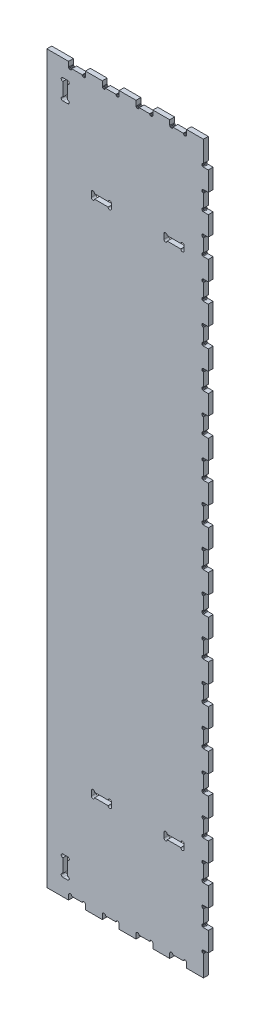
from build123d import *

# Parameters (mm, degrees)
BOSS_EXTRUDE1_DEPTH = 12


with BuildPart() as part:
    # Sketch1 → Boss-Extrude1 (new body)
    with BuildSketch(Plane.XY):
        Polygon((-145.403955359, -2312), (-145.287955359, -2312), (-145.287955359, -2311.04), (-144.397955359, -2309.35), (-142.822955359, -2308.26), (-140.921955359, -2308.03), (-139.131955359, -2308.71), (-137.861955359, -2310.14), (-137.403955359, -2312), (-111.509955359, -2312), (-111.509955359, -2311.04), (-110.619955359, -2309.35), (-109.044955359, -2308.26), (-107.143955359, -2308.03), (-105.353955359, -2308.71), (-104.084955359, -2310.14), (-103.625955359, -2312), (-103.625955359, -2324), (-61.848655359, -2324), (-61.848655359, -2312), (-61.732355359, -2312), (-61.732355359, -2311.04), (-60.842655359, -2309.35), (-59.267055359, -2308.26), (-57.366455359, -2308.03), (-55.576355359, -2308.71), (-54.306755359, -2310.14), (-53.848655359, -2312), (-27.954555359, -2312), (-27.954555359, -2311.04), (-27.064855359, -2309.35), (-25.489255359, -2308.26), (-23.588655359, -2308.03), (-21.798555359, -2308.71), (-20.529055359, -2310.14), (-20.070855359, -2312), (-20.070855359, -2324), (21.706944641, -2324), (21.706944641, -2312), (21.823144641, -2312), (21.823144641, -2311.04), (22.712844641, -2309.35), (24.288544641, -2308.26), (26.189044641, -2308.03), (27.979144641, -2308.71), (29.248744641, -2310.14), (29.706944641, -2312), (55.600944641, -2312), (55.600944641, -2311.04), (56.490644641, -2309.35), (58.066244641, -2308.26), (59.966844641, -2308.03), (61.756944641, -2308.71), (63.026544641, -2310.14), (63.484744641, -2312), (63.484744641, -2324), (105.262044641, -2324), (105.262044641, -2312), (105.379044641, -2312), (105.379044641, -2311.04), (106.268044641, -2309.35), (107.844044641, -2308.26), (109.745044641, -2308.03), (111.535044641, -2308.71), (112.804044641, -2310.14), (113.262044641, -2312), (139.156044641, -2312), (139.156044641, -2311.04), (140.046044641, -2309.35), (141.622044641, -2308.26), (143.522044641, -2308.03), (145.312044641, -2308.71), (146.582044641, -2310.14), (147.040044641, -2312), (147.040044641, -2324), (188.818044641, -2324), (188.818044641, -2271.91), (187.400044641, -2271.74), (185.824044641, -2270.65), (184.934044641, -2268.96), (184.934044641, -2267.04), (185.824044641, -2265.35), (187.400044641, -2264.26), (189.300044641, -2264.03), (189.751044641, -2264.2), (200.818044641, -2264.2), (200.818044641, -2216), (188.818044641, -2216), (188.818044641, -2215.91), (187.400044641, -2215.74), (185.824044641, -2214.65), (184.934044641, -2212.96), (184.934044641, -2211.04), (185.824044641, -2209.35), (187.400044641, -2208.26), (188.818044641, -2208.09), (188.818044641, -2175.91), (187.400044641, -2175.74), (185.824044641, -2174.65), (184.934044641, -2172.96), (184.934044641, -2171.04), (185.824044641, -2169.35), (187.400044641, -2168.26), (189.300044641, -2168.03), (189.751044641, -2168.2), (200.818044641, -2168.2), (200.818044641, -2120), (188.818044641, -2120), (188.818044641, -2119.91), (187.400044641, -2119.74), (185.824044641, -2118.65), (184.934044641, -2116.96), (184.934044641, -2115.04), (185.824044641, -2113.35), (187.400044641, -2112.26), (188.818044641, -2112.09), (188.818044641, -2079.91), (187.400044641, -2079.74), (185.824044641, -2078.65), (184.934044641, -2076.96), (184.934044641, -2075.04), (185.824044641, -2073.35), (187.400044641, -2072.26), (189.300044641, -2072.03), (189.751044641, -2072.2), (200.818044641, -2072.2), (200.818044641, -2024), (188.818044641, -2024), (188.818044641, -2023.91), (187.400044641, -2023.74), (185.824044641, -2022.65), (184.934044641, -2020.96), (184.934044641, -2019.04), (185.824044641, -2017.35), (187.400044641, -2016.26), (188.818044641, -2016.09), (188.818044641, -1983.91), (187.400044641, -1983.74), (185.824044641, -1982.65), (184.934044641, -1980.96), (184.934044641, -1979.04), (185.824044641, -1977.35), (187.400044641, -1976.26), (189.300044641, -1976.03), (189.751044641, -1976.2), (200.818044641, -1976.2), (200.818044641, -1928), (188.818044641, -1928), (188.818044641, -1927.91), (187.400044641, -1927.74), (185.824044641, -1926.65), (184.934044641, -1924.96), (184.934044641, -1923.04), (185.824044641, -1921.35), (187.400044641, -1920.26), (188.818044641, -1920.09), (188.818044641, -1887.91), (187.400044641, -1887.74), (185.824044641, -1886.65), (184.934044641, -1884.96), (184.934044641, -1883.04), (185.824044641, -1881.35), (187.400044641, -1880.26), (189.300044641, -1880.03), (189.751044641, -1880.2), (200.818044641, -1880.2), (200.818044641, -1832), (188.818044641, -1832), (188.818044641, -1831.91), (187.400044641, -1831.74), (185.824044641, -1830.65), (184.934044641, -1828.96), (184.934044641, -1827.04), (185.824044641, -1825.35), (187.400044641, -1824.26), (188.818044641, -1824.09), (188.818044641, -1791.91), (187.400044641, -1791.74), (185.824044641, -1790.65), (184.934044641, -1788.96), (184.934044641, -1787.04), (185.824044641, -1785.35), (187.400044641, -1784.26), (189.300044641, -1784.03), (189.751044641, -1784.2), (200.818044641, -1784.2), (200.818044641, -1736), (188.818044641, -1736), (188.818044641, -1735.91), (187.400044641, -1735.74), (185.824044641, -1734.65), (184.934044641, -1732.96), (184.934044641, -1731.04), (185.824044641, -1729.35), (187.400044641, -1728.26), (188.818044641, -1728.09), (188.818044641, -1695.91), (187.400044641, -1695.74), (185.824044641, -1694.65), (184.934044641, -1692.96), (184.934044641, -1691.04), (185.824044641, -1689.35), (187.400044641, -1688.26), (189.300044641, -1688.03), (189.751044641, -1688.2), (200.818044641, -1688.2), (200.818044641, -1640), (188.818044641, -1640), (188.818044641, -1639.91), (187.400044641, -1639.74), (185.824044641, -1638.65), (184.934044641, -1636.96), (184.934044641, -1635.04), (185.824044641, -1633.35), (187.400044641, -1632.26), (188.818044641, -1632.09), (188.818044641, -1599.91), (187.400044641, -1599.74), (185.824044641, -1598.65), (184.934044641, -1596.96), (184.934044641, -1595.04), (185.824044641, -1593.35), (187.400044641, -1592.26), (189.300044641, -1592.03), (189.751044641, -1592.2), (200.818044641, -1592.2), (200.818044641, -1544), (188.818044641, -1544), (188.818044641, -1543.91), (187.400044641, -1543.74), (185.824044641, -1542.65), (184.934044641, -1540.96), (184.934044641, -1539.04), (185.824044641, -1537.35), (187.400044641, -1536.26), (188.818044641, -1536.09), (188.818044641, -1503.91), (187.400044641, -1503.74), (185.824044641, -1502.65), (184.934044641, -1500.96), (184.934044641, -1499.04), (185.824044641, -1497.35), (187.400044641, -1496.26), (189.300044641, -1496.03), (189.751044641, -1496.2), (200.818044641, -1496.2), (200.818044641, -1448), (188.818044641, -1448), (188.818044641, -1447.91), (187.400044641, -1447.74), (185.824044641, -1446.65), (184.934044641, -1444.96), (184.934044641, -1443.04), (185.824044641, -1441.35), (187.400044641, -1440.26), (188.818044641, -1440.09), (188.818044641, -1407.91), (187.400044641, -1407.74), (185.824044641, -1406.65), (184.934044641, -1404.96), (184.934044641, -1403.04), (185.824044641, -1401.35), (187.400044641, -1400.26), (189.300044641, -1400.03), (189.751044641, -1400.2), (200.818044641, -1400.2), (200.818044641, -1352), (188.818044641, -1352), (188.818044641, -1351.91), (187.400044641, -1351.74), (185.824044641, -1350.65), (184.934044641, -1348.96), (184.934044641, -1347.04), (185.824044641, -1345.35), (187.400044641, -1344.26), (188.818044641, -1344.09), (188.818044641, -1311.91), (187.400044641, -1311.74), (185.824044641, -1310.65), (184.934044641, -1308.96), (184.934044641, -1307.04), (185.824044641, -1305.35), (187.400044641, -1304.26), (189.300044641, -1304.03), (189.751044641, -1304.2), (200.818044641, -1304.2), (200.818044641, -1256), (188.818044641, -1256), (188.818044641, -1255.91), (187.400044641, -1255.74), (185.824044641, -1254.65), (184.934044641, -1252.96), (184.934044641, -1251.04), (185.824044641, -1249.35), (187.400044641, -1248.26), (188.818044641, -1248.09), (188.818044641, -1215.91), (187.400044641, -1215.74), (185.824044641, -1214.65), (184.934044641, -1212.96), (184.934044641, -1211.04), (185.824044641, -1209.35), (187.400044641, -1208.26), (189.300044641, -1208.03), (189.751044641, -1208.2), (200.818044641, -1208.2), (200.818044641, -1160), (188.818044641, -1160), (188.818044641, -1159.91), (187.400044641, -1159.74), (185.824044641, -1158.65), (184.934044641, -1156.96), (184.934044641, -1155.04), (185.824044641, -1153.35), (187.400044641, -1152.26), (188.818044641, -1152.09), (188.818044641, -1119.91), (187.400044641, -1119.74), (185.824044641, -1118.65), (184.934044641, -1116.96), (184.934044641, -1115.04), (185.824044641, -1113.35), (187.400044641, -1112.26), (189.300044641, -1112.03), (189.751044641, -1112.2), (200.818044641, -1112.2), (200.818044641, -1064), (188.818044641, -1064), (188.818044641, -1063.91), (187.400044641, -1063.74), (185.824044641, -1062.65), (184.934044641, -1060.96), (184.934044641, -1059.04), (185.824044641, -1057.35), (187.400044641, -1056.26), (188.818044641, -1056.09), (188.818044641, -1023.91), (187.400044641, -1023.74), (185.824044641, -1022.65), (184.934044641, -1020.96), (184.934044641, -1019.04), (185.824044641, -1017.35), (187.400044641, -1016.26), (189.300044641, -1016.03), (189.751044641, -1016.2), (200.818044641, -1016.2), (200.818044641, -968), (188.818044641, -968), (188.818044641, -967.912), (187.400044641, -967.74), (185.824044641, -966.652), (184.934044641, -964.957), (184.934044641, -963.043), (185.824044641, -961.348), (187.400044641, -960.26), (188.818044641, -960.088), (188.818044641, -927.912), (187.400044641, -927.74), (185.824044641, -926.652), (184.934044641, -924.957), (184.934044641, -923.043), (185.824044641, -921.348), (187.400044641, -920.26), (189.300044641, -920.029), (189.751044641, -920.2), (200.818044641, -920.2), (200.818044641, -872), (188.818044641, -872), (188.818044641, -871.912), (187.400044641, -871.74), (185.824044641, -870.652), (184.934044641, -868.957), (184.934044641, -867.043), (185.824044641, -865.348), (187.400044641, -864.26), (188.818044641, -864.088), (188.818044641, -831.912), (187.400044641, -831.74), (185.824044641, -830.652), (184.934044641, -828.957), (184.934044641, -827.043), (185.824044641, -825.348), (187.400044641, -824.26), (189.300044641, -824.029), (189.751044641, -824.2), (200.818044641, -824.2), (200.818044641, -776), (188.818044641, -776), (188.818044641, -775.912), (187.400044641, -775.74), (185.824044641, -774.652), (184.934044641, -772.957), (184.934044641, -771.043), (185.824044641, -769.348), (187.400044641, -768.26), (188.818044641, -768.088), (188.818044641, -735.912), (187.400044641, -735.74), (185.824044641, -734.652), (184.934044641, -732.957), (184.934044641, -731.043), (185.824044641, -729.348), (187.400044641, -728.26), (189.300044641, -728.029), (189.751044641, -728.2), (200.818044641, -728.2), (200.818044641, -680), (188.818044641, -680), (188.818044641, -679.912), (187.400044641, -679.74), (185.824044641, -678.652), (184.934044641, -676.957), (184.934044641, -675.043), (185.824044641, -673.348), (187.400044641, -672.26), (188.818044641, -672.088), (188.818044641, -639.912), (187.400044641, -639.74), (185.824044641, -638.652), (184.934044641, -636.957), (184.934044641, -635.043), (185.824044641, -633.348), (187.400044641, -632.26), (189.300044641, -632.029), (189.751044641, -632.2), (200.818044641, -632.2), (200.818044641, -584), (188.818044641, -584), (188.818044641, -583.912), (187.400044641, -583.74), (185.824044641, -582.652), (184.934044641, -580.957), (184.934044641, -579.043), (185.824044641, -577.348), (187.400044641, -576.26), (188.818044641, -576.088), (188.818044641, -524), (147.040044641, -524), (147.040044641, -536), (146.582044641, -537.859), (145.312044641, -539.292), (143.522044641, -539.971), (141.622044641, -539.74), (140.046044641, -538.652), (139.156044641, -536.957), (139.156044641, -536), (113.262044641, -536), (112.804044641, -537.859), (111.535044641, -539.292), (109.745044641, -539.971), (107.844044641, -539.74), (106.268044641, -538.652), (105.379044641, -536.957), (105.379044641, -536), (105.262044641, -536), (105.262044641, -524), (63.484744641, -524), (63.484744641, -536), (63.026544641, -537.859), (61.756944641, -539.292), (59.966844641, -539.971), (58.066244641, -539.74), (56.490644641, -538.652), (55.600944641, -536.957), (55.600944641, -536), (29.706944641, -536), (29.248744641, -537.859), (27.979144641, -539.292), (26.189044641, -539.971), (24.288544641, -539.74), (22.712844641, -538.652), (21.823144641, -536.957), (21.823144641, -536), (21.706944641, -536), (21.706944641, -524), (-20.070855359, -524), (-20.070855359, -536), (-20.529055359, -537.859), (-21.798555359, -539.292), (-23.588655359, -539.971), (-25.489255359, -539.74), (-27.064855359, -538.652), (-27.954555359, -536.957), (-27.954555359, -536), (-53.848655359, -536), (-54.306755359, -537.859), (-55.576355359, -539.292), (-57.366455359, -539.971), (-59.267055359, -539.74), (-60.842655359, -538.652), (-61.732355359, -536.957), (-61.732355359, -536), (-61.848655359, -536), (-61.848655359, -524), (-103.625955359, -524), (-103.625955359, -536), (-104.084955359, -537.859), (-105.353955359, -539.292), (-107.143955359, -539.971), (-109.044955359, -539.74), (-110.619955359, -538.652), (-111.509955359, -536.957), (-111.509955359, -536), (-137.403955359, -536), (-137.861955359, -537.859), (-139.131955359, -539.292), (-140.921955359, -539.971), (-142.822955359, -539.74), (-144.397955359, -538.652), (-145.287955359, -536.957), (-145.287955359, -536), (-145.403955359, -536), (-145.403955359, -524), (-199.181955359, -524), (-199.181955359, -2324), (-145.403955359, -2324), align=None)
        with BuildLine():
            Line((-147.741955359, -2282), (-159.541955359, -2282))
            ThreePointArc((-159.541955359, -2282), (-163.641955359, -2277.9), (-159.541955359, -2273.8))
            Line((-159.541955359, -2273.8), (-159.541955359, -2240.2))
            ThreePointArc((-159.541955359, -2240.2), (-163.641955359, -2236.1), (-159.541955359, -2232))
            Line((-159.541955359, -2232), (-147.741955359, -2232))
            ThreePointArc((-147.741955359, -2232), (-143.641955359, -2236.1), (-147.741955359, -2240.2))
            Line((-147.741955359, -2240.2), (-147.741955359, -2273.8))
            ThreePointArc((-147.741955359, -2273.8), (-143.641955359, -2277.9), (-147.741955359, -2282))
        make_face(mode=Mode.SUBTRACT)
        with BuildLine():
            Line((-159.541955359, -574.2), (-159.541955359, -607.8))
            ThreePointArc((-159.541955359, -607.8), (-163.641955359, -611.9), (-159.541955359, -616))
            Line((-159.541955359, -616), (-147.741955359, -616))
            ThreePointArc((-147.741955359, -616), (-143.641955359, -611.9), (-147.741955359, -607.8))
            Line((-147.741955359, -607.8), (-147.741955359, -574.2))
            ThreePointArc((-147.741955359, -574.2), (-143.641955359, -570.1), (-147.741955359, -566))
            Line((-147.741955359, -566), (-159.541955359, -566))
            ThreePointArc((-159.541955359, -566), (-163.641955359, -570.1), (-159.541955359, -574.2))
        make_face(mode=Mode.SUBTRACT)
        with BuildLine():
            Line((99.018044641, -2072.2), (132.618044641, -2072.2))
            ThreePointArc((132.618044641, -2072.2), (136.818044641, -2076.2), (140.818044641, -2072))
            Line((140.818044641, -2072), (140.818044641, -2060.2))
            ThreePointArc((140.818044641, -2060.2), (136.618044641, -2056.2), (132.618044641, -2060.4))
            Line((132.618044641, -2060.4), (99.018044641, -2060.4))
            ThreePointArc((99.018044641, -2060.4), (94.918044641, -2056.3), (90.818044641, -2060.4))
            Line((90.818044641, -2060.4), (90.818044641, -2072.2))
            ThreePointArc((90.818044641, -2072.2), (94.918044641, -2076.3), (99.018044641, -2072.2))
        make_face(mode=Mode.SUBTRACT)
        with BuildLine():
            Line((-80.981955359, -2072.2), (-47.381955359, -2072.2))
            ThreePointArc((-47.381955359, -2072.2), (-43.181955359, -2076.2), (-39.181955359, -2072))
            Line((-39.181955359, -2072), (-39.181955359, -2060.2))
            ThreePointArc((-39.181955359, -2060.2), (-43.381955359, -2056.2), (-47.381955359, -2060.4))
            Line((-47.381955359, -2060.4), (-80.981955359, -2060.4))
            ThreePointArc((-80.981955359, -2060.4), (-85.081955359, -2056.3), (-89.181955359, -2060.4))
            Line((-89.181955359, -2060.4), (-89.181955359, -2072.2))
            ThreePointArc((-89.181955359, -2072.2), (-85.081955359, -2076.3), (-80.981955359, -2072.2))
        make_face(mode=Mode.SUBTRACT)
        with BuildLine():
            Line((-89.181955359, -787.6), (-89.181955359, -775.8))
            ThreePointArc((-89.181955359, -775.8), (-85.081955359, -771.7), (-80.981955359, -775.8))
            Line((-80.981955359, -775.8), (-47.381955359, -775.8))
            ThreePointArc((-47.381955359, -775.8), (-43.181955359, -771.8), (-39.181955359, -776))
            Line((-39.181955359, -776), (-39.181955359, -787.8))
            ThreePointArc((-39.181955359, -787.8), (-43.381955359, -791.8), (-47.381955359, -787.6))
            Line((-47.381955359, -787.6), (-80.981955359, -787.6))
            ThreePointArc((-80.981955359, -787.6), (-85.081955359, -791.7), (-89.181955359, -787.6))
        make_face(mode=Mode.SUBTRACT)
        with BuildLine():
            Line((90.818044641, -787.6), (90.818044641, -775.8))
            ThreePointArc((90.818044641, -775.8), (94.918044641, -771.7), (99.018044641, -775.8))
            Line((99.018044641, -775.8), (132.618044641, -775.8))
            ThreePointArc((132.618044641, -775.8), (136.818044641, -771.8), (140.818044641, -776))
            Line((140.818044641, -776), (140.818044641, -787.8))
            ThreePointArc((140.818044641, -787.8), (136.618044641, -791.8), (132.618044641, -787.6))
            Line((132.618044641, -787.6), (99.018044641, -787.6))
            ThreePointArc((99.018044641, -787.6), (94.918044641, -791.7), (90.818044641, -787.6))
        make_face(mode=Mode.SUBTRACT)
    extrude(amount=BOSS_EXTRUDE1_DEPTH)


solid = part.part
